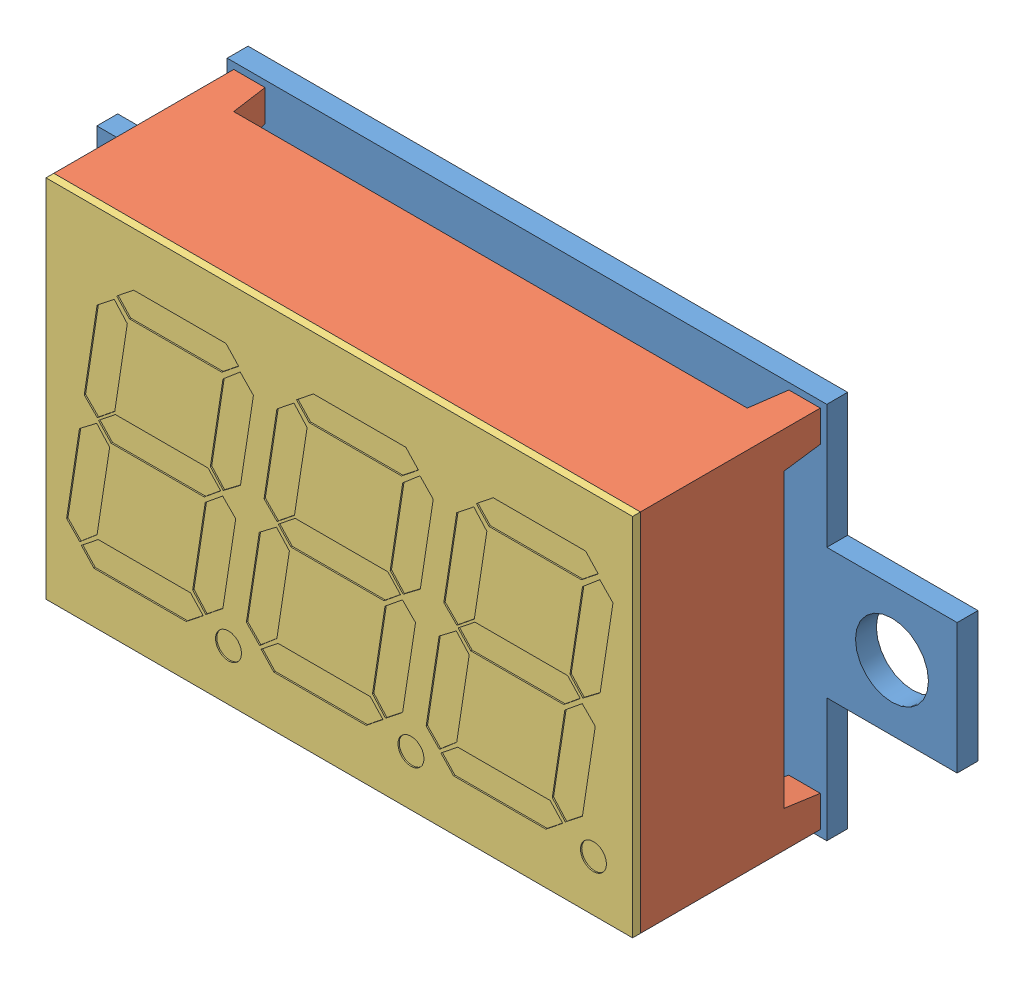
SolidWorks assembly Assem1.sldasm, configuration Default (file format 12000). Lengths in mm.
Overall size (33 14.5 8).
3 component instances, 3 part files, 6 mates.
Components (placement in the parent):
- VoltageLCD_PCB-1: VoltageLCD_PCB.SLDPRT [Default] at (19.4082 25.7362 26.7979) size (33 14.5 0.8)
- VoltageLCDBody-1: VoltageLCDBody.SLDPRT [Default] at (19.1582 25.4862 31.3479) size (22.5 14 6.9)
- VoltageLCDScreen-1: VoltageLCDScreen.SLDPRT [Default] at (19.1582 25.4862 34.2479) size (22.5 14 0.3)
Mates (geometry in assembly coordinates):
- Width1: width: plane of VoltageLCDBody-1 through (19.1582 25.4862 34.0979) normal (0 1 0); plane of VoltageLCD_PCB-1 through (19.1582 11.4862 34.0979) normal (0 -1 0); plane of VoltageLCDBody-1 through (19.4082 25.7362 27.1979) normal (0 1 0); plane of VoltageLCD_PCB-1 through (19.4082 11.2362 27.1979) normal (0 -1 0)
- Width2: width: plane of VoltageLCDBody-1 through (19.1582 25.4862 34.0979) normal (1 0 0); plane of VoltageLCD_PCB-1 through (-3.3418 25.4862 34.0979) normal (-1 0 0); plane of VoltageLCDBody-1 through (-8.5918 25.7362 27.1979) normal (-1 0 0); plane of VoltageLCD_PCB-1 through (24.4082 25.7362 27.1979) normal (1 0 0)
- Coincident1: coincident anti-aligned: plane of VoltageLCD_PCB-1 through (19.4082 25.7362 27.1979) normal (0 0 1); plane of VoltageLCDBody-1 through (19.1582 25.4862 27.1979) normal (0 0 -1)
- Width3: width: plane of VoltageLCDScreen-1 through (19.1582 25.4862 34.3979) normal (0 1 0); plane of VoltageLCDBody-1 through (19.1582 11.4862 34.3979) normal (0 -1 0); plane of VoltageLCDScreen-1 through (19.1582 11.4862 34.0979) normal (0 -1 0); plane of VoltageLCDBody-1 through (19.1582 25.4862 34.0979) normal (0 1 0)
- Width4: width: plane of VoltageLCDScreen-1 through (19.1582 25.4862 34.3979) normal (1 0 0); plane of VoltageLCDBody-1 through (-3.3418 25.4862 34.3979) normal (-1 0 0); plane of VoltageLCDScreen-1 through (-3.3418 25.4862 34.0979) normal (-1 0 0); plane of VoltageLCDBody-1 through (19.1582 25.4862 34.0979) normal (1 0 0)
- Coincident2: coincident anti-aligned: plane of VoltageLCDBody-1 through (19.1582 25.4862 34.0979) normal (0 0 1); plane of VoltageLCDScreen-1 through (19.1582 25.4862 34.0979) normal (0 0 -1)
